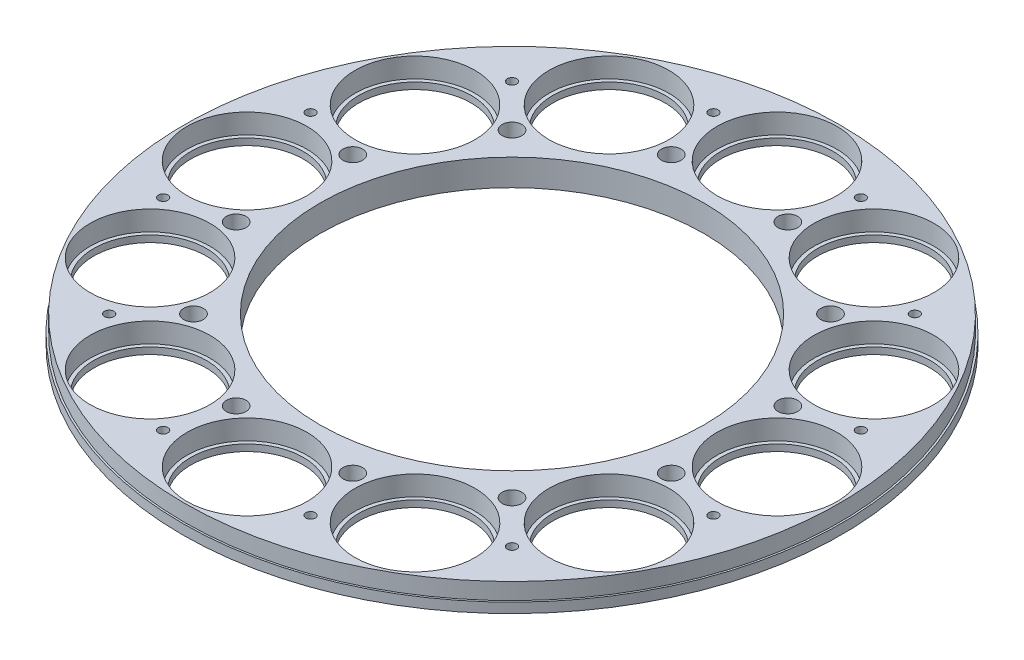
from build123d import *

# Parameters (mm, degrees)
SKETCH1_R                      = 157.95625
BOSS_EXTRUDE1_DEPTH            = 12.7
SKETCH2_R                      = 28.7655
CUT_EXTRUDE1_DEPTH             = 9.525
SKETCH3_R                      = 26.9875
CUT_EXTRUDE2_DEPTH             = 224.586849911
CIRPATTERN1_COUNT              = 12
SKETCH4_R                      = 92.075
CUT_EXTRUDE3_DEPTH             = 224.744595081
SKETCH5_W                      = 0.889
SKETCH5_H                      = 7.9375
CIRPATTERN2_COUNT              = 12
SKETCH12_R                     = 1.27
CUT_EXTRUDE5_DEPTH             = 224.744595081
CBORE_FOR_M4_SHCS2_D           = 4.5
CBORE_FOR_M4_SHCS2_DEPTH       = 12.7
CBORE_FOR_M4_SHCS2_CBORE_D     = 11.43
CBORE_FOR_M4_SHCS2_CBORE_DEPTH = 6
CUT_EXTRUDE6_START             = -6
CUT_EXTRUDE6_DEPTH             = 6
CIRPATTERN4_COUNT              = 12
CUT_EXTRUDE7_DEPTH             = 1.27


with BuildPart() as part:
    # Sketch1 → Boss-Extrude1 (new body)
    with BuildSketch(Plane(origin=(0, 0, 0), x_dir=(1, 0, 0), z_dir=(0, 1, 0))):
        with Locations(Location((0, 0, 0), (0, 0, 270))):
            Circle(SKETCH1_R)
    extrude(amount=BOSS_EXTRUDE1_DEPTH)

    # Sketch2 → Cut-Extrude1 (cut)
    with BuildSketch(Plane(origin=(0, 12.7, 0), x_dir=(1, 0, 0), z_dir=(0, 1, 0))):
        with Locations(Location((0, 127, 0), (0, 0, 270))):
            Circle(SKETCH2_R)
    cut_extrude1 = extrude(amount=-CUT_EXTRUDE1_DEPTH, mode=Mode.SUBTRACT)

    # Sketch3 → Cut-Extrude2 (cut, through all)
    with BuildSketch(Plane(origin=(0, 3.175, 0), x_dir=(1, 0, 0), z_dir=(0, 1, 0))):
        with Locations(Location((0, 127, 0), (0, 0, 270))):
            Circle(SKETCH3_R)
    cut_extrude2 = extrude(amount=-CUT_EXTRUDE2_DEPTH, mode=Mode.SUBTRACT)

    # CirPattern1: Cut-Extrude1, Cut-Extrude2 ×12 about axis
    cirpattern1_axis = Axis((0, 0, 0), (0, 1, 0))
    add([cut_extrude1.rotate(cirpattern1_axis, i * 360 / CIRPATTERN1_COUNT) for i in range(1, CIRPATTERN1_COUNT)], mode=Mode.SUBTRACT)
    add([cut_extrude2.rotate(cirpattern1_axis, i * 360 / CIRPATTERN1_COUNT) for i in range(1, CIRPATTERN1_COUNT)], mode=Mode.SUBTRACT)

    # Sketch4 → Cut-Extrude3 (cut, through all)
    with BuildSketch(Plane(origin=(0, 12.7, 0), x_dir=(1, 0, 0), z_dir=(0, 1, 0))):
        with Locations(Location((0, 0, 0), (0, 0, 270))):
            Circle(SKETCH4_R)
    extrude(amount=-CUT_EXTRUDE3_DEPTH, mode=Mode.SUBTRACT)

    # Sketch5 → Cut-Revolve1 (revolve, cut)
    with BuildSketch(Plane.XY, mode=Mode.PRIVATE) as cut_revolve1_sk:
        with Locations((157.51175, 8.73125)):
            Rectangle(SKETCH5_W, SKETCH5_H)
    revolve(cut_revolve1_sk.sketch.rotate(Axis((0, 50, 0), (0, -1, 0)), 90), axis=Axis((0, 50, 0), (0, -1, 0)), mode=Mode.SUBTRACT)

    # Sketch9 → CSK for M4 Flat Head Machine Screw1 (revolve, cut)
    with BuildSketch(Plane(origin=(27.939515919, 12.7, -104.271692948), x_dir=(0, 0, 1), z_dir=(1, 0, 0))):
        Polygon((0, 0), (0, 12.7), (2.25, 12.7), (2.25, 10.4500094), (4.7, 8.0000094), (4.7, 0), align=None)
    csk_for_m4_flat_head_machine_screw1 = revolve(axis=Axis((27.939515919, 19.05, -104.271692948), (0, -1, 0)), mode=Mode.SUBTRACT)

    # CirPattern2: CSK for M4 Flat Head Machine Screw1 ×12 about axis
    cirpattern2_axis = Axis((0, 0, 0), (0, 1, 0))
    for i in range(1, CIRPATTERN2_COUNT):
        add(csk_for_m4_flat_head_machine_screw1.rotate(cirpattern2_axis, i * 360 / CIRPATTERN2_COUNT), mode=Mode.SUBTRACT)

    # Sketch12 → Cut-Extrude5 (cut, through all)
    with BuildSketch(Plane(origin=(0, 0, 0), x_dir=(1, 0, 0), z_dir=(0, 1, 0))):
        with Locations(Location((35.335270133, 131.873023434, 0), (0, 0, 270))):
            Circle(SKETCH12_R)
    cut_extrude5 = extrude(amount=CUT_EXTRUDE5_DEPTH, mode=Mode.SUBTRACT)

    # CBORE for M4 SHCS2
    with Locations(Plane(origin=(0, 0, 0), x_dir=(-1, 0, 0), z_dir=(0, -1, 0))):
        with Locations((-35.335270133, 131.873023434)):
            cbore_for_m4_shcs2 = CounterBoreHole(CBORE_FOR_M4_SHCS2_D / 2, CBORE_FOR_M4_SHCS2_CBORE_D / 2, CBORE_FOR_M4_SHCS2_CBORE_DEPTH, depth=CBORE_FOR_M4_SHCS2_DEPTH)

    # Sketch17 → Cut-Extrude6 (cut)
    with BuildSketch(Plane.XZ.offset(CUT_EXTRUDE6_START)):
        with BuildLine():
            Line((33.161937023, -132.455366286), (29.874935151, -120.188108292))
            ThreePointArc((29.874935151, -120.188108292), (31.465925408, -117.432432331), (34.221601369, -119.023422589))
            Line((34.221601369, -119.023422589), (37.508603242, -131.290680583))
            ThreePointArc((37.508603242, -131.290680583), (35.917612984, -134.046356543), (33.161937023, -132.455366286))
        make_face()
    cut_extrude6 = extrude(amount=CUT_EXTRUDE6_DEPTH, mode=Mode.SUBTRACT)

    # CirPattern4: Cut-Extrude5, CBORE for M4 SHCS2, Cut-Extrude6 ×12 about axis
    cirpattern4_axis = Axis((0, 0, 0), (0, 1, 0))
    add([cut_extrude5.rotate(cirpattern4_axis, i * 360 / CIRPATTERN4_COUNT) for i in range(1, CIRPATTERN4_COUNT)], mode=Mode.SUBTRACT)
    add([cbore_for_m4_shcs2.rotate(cirpattern4_axis, i * 360 / CIRPATTERN4_COUNT) for i in range(1, CIRPATTERN4_COUNT)], mode=Mode.SUBTRACT)
    add([cut_extrude6.rotate(cirpattern4_axis, i * 360 / CIRPATTERN4_COUNT) for i in range(1, CIRPATTERN4_COUNT)], mode=Mode.SUBTRACT)

    # Sketch18 → Cut-Extrude7 (cut)
    # profile 1 of 15: a face of its own
    with BuildSketch(Plane.XZ):
        Polygon((-145.522341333, -32.08280496), (-147.287926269, -32.417350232), (-148.45947074, -26.218722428), (-147.287926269, -25.996116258), (-146.32499558, -31.086801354), (-145.049144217, -30.846386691), align=None)
    # profile 2 of 15: a face of its own
    with BuildSketch(Plane.XZ):
        with BuildLine():
            Line((-111.4209288, -99.098916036), (-110.520327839, -98.343327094))
            add(Edge.make_bspline(
                [(-110.520327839, -98.343327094), (-110.470740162, -98.410328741), (-110.373838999, -98.541259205), (-110.252591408, -98.747636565), (-110.149053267, -98.95241026), (-110.069738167, -99.159129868), (-110.013791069, -99.366868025), (-109.977079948, -99.574567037), (-109.964681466, -99.783622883), (-109.973786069, -99.991545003), (-110.002623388, -100.196205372), (-110.052577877, -100.394895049), (-110.12297787, -100.586098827), (-110.212347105, -100.770503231), (-110.322457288, -100.946974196), (-110.453691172, -101.114912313), (-110.602236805, -101.277986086), (-110.714781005, -101.376491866), (-110.772190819, -101.426740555)],
                knots=[0, 0, 0, 0, 1.154744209, 2.256529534, 3.313242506, 4.332799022, 5.319499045, 6.291612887, 7.251495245, 8.216331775, 9.172264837, 10.111720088, 11.050789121, 11.991897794, 12.947650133, 13.928168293, 14.943139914, 16, 16, 16, 16], degree=3))
            add(Edge.make_bspline(
                [(-110.772190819, -101.426740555), (-110.845473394, -101.484628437), (-110.988458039, -101.597575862), (-111.221663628, -101.731668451), (-111.46055209, -101.83377964), (-111.70633825, -101.90016235), (-111.955021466, -101.932724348), (-112.205513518, -101.928254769), (-112.45587317, -101.889898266), (-112.701935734, -101.816840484), (-112.93676861, -101.717226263), (-113.149697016, -101.589329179), (-113.34378118, -101.444500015), (-113.450304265, -101.326424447), (-113.503250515, -101.267736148)],
                knots=[0, 0, 0, 0, 1.102726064, 2.151574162, 3.169101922, 4.166152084, 5.151568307, 6.12408846, 7.117958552, 8.136276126, 9.151158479, 10.124259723, 11.067681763, 12, 12, 12, 12], degree=3))
            add(Edge.make_bspline(
                [(-113.503250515, -101.267736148), (-113.533107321, -101.230869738), (-113.593547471, -101.156239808), (-113.67435109, -101.03423535), (-113.751064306, -100.904668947), (-113.820700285, -100.765914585), (-113.883970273, -100.619094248), (-113.943310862, -100.464567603), (-113.994719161, -100.300828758), (-114.041012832, -100.127360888), (-114.081395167, -99.941684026), (-114.110205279, -99.740490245), (-114.135911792, -99.523474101), (-114.147743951, -99.289837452), (-114.156488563, -99.040049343), (-114.154134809, -98.774051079), (-114.145559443, -98.491563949), (-114.13384611, -98.297933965), (-114.127819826, -98.198315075)],
                knots=[0, 0, 0, 0, 0.709226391, 1.43571115, 2.186242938, 2.960568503, 3.755882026, 4.576878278, 5.435356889, 6.321480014, 7.26188766, 8.27545705, 9.360351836, 10.529408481, 11.773070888, 13.098615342, 14.507293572, 16, 16, 16, 16], degree=3))
            Line((-114.127819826, -98.198315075), (-114.064218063, -97.167966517))
            Line((-114.064218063, -97.167966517), (-115.792913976, -98.618086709))
            Line((-115.792913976, -98.618086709), (-116.510341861, -97.763279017))
            Line((-116.510341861, -97.763279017), (-113.148352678, -94.943176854))
            Line((-113.148352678, -94.943176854), (-112.776918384, -95.385845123))
            Line((-112.776918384, -95.385845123), (-112.994436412, -98.17541844))
            add(Edge.make_bspline(
                [(-112.994436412, -98.17541844), (-113.000791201, -98.256801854), (-113.013029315, -98.413530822), (-113.024005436, -98.640900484), (-113.031151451, -98.851664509), (-113.030918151, -99.046799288), (-113.026160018, -99.225398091), (-113.016442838, -99.387978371), (-113.000589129, -99.534177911), (-112.970247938, -99.703306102), (-112.922881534, -99.892498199), (-112.84729198, -100.095330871), (-112.760576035, -100.274843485), (-112.684006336, -100.375806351), (-112.647170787, -100.424376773)],
                knots=[0, 0, 0, 0, 1.261671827, 2.42973983, 3.518165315, 4.520897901, 5.445356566, 6.279339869, 7.037828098, 7.716645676, 8.934243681, 10.045727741, 11.059854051, 12, 12, 12, 12], degree=3))
            add(Edge.make_bspline(
                [(-112.647170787, -100.424376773), (-112.607232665, -100.467733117), (-112.529729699, -100.551869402), (-112.388493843, -100.645926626), (-112.235906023, -100.710567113), (-112.071754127, -100.738774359), (-111.904150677, -100.735852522), (-111.739589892, -100.695998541), (-111.579975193, -100.623846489), (-111.486157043, -100.551149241), (-111.437465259, -100.513419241)],
                knots=[0, 0, 0, 0, 1.037778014, 2.013887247, 2.970618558, 3.944427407, 4.933093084, 5.910235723, 6.915408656, 8, 8, 8, 8], degree=3))
            add(Edge.make_bspline(
                [(-111.437465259, -100.513419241), (-111.413717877, -100.492239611), (-111.367096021, -100.450658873), (-111.305695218, -100.381837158), (-111.254336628, -100.308027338), (-111.210546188, -100.230353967), (-111.176690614, -100.147729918), (-111.150606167, -100.061327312), (-111.134323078, -99.970429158), (-111.124048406, -99.843118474), (-111.136476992, -99.678702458), (-111.190099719, -99.48084783), (-111.286527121, -99.284588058), (-111.374880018, -99.162531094), (-111.4209288, -99.098916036)],
                knots=[0, 0, 0, 0, 0.725732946, 1.424789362, 2.098546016, 2.774245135, 3.455257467, 4.131787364, 4.830173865, 5.558160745, 7.042345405, 8.565596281, 10.210017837, 12, 12, 12, 12], degree=3))
        make_face()
    # profile 3 of 15: a face of its own
    with BuildSketch(Plane.XZ):
        with BuildLine():
            Line((-46.573525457, -141.800478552), (-46.180466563, -140.720520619))
            add(Edge.make_bspline(
                [(-46.180466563, -140.720520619), (-46.130005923, -140.747779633), (-46.030995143, -140.801265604), (-45.892095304, -140.892612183), (-45.763247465, -140.988396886), (-45.64706625, -141.092221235), (-45.541658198, -141.201810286), (-45.449482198, -141.31919422), (-45.366186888, -141.441701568), (-45.321392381, -141.529026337), (-45.29894613, -141.572784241)],
                knots=[0, 0, 0, 0, 1.102522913, 2.163303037, 3.194038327, 4.187487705, 5.156472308, 6.114171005, 7.055022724, 8, 8, 8, 8], degree=3))
            add(Edge.make_bspline(
                [(-45.29894613, -141.572784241), (-45.271428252, -141.634200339), (-45.216805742, -141.756110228), (-45.157233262, -141.945848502), (-45.118763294, -142.138202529), (-45.100871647, -142.332638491), (-45.103563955, -142.529166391), (-45.126767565, -142.728226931), (-45.171357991, -142.929233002), (-45.215494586, -143.061416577), (-45.237888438, -143.128483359)],
                knots=[0, 0, 0, 0, 1.007880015, 2.000624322, 2.972613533, 3.94252362, 4.921136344, 5.912639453, 6.940923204, 8, 8, 8, 8], degree=3))
            add(Edge.make_bspline(
                [(-45.237888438, -143.128483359), (-45.260506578, -143.187489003), (-45.304996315, -143.303552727), (-45.390036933, -143.466575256), (-45.485450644, -143.617488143), (-45.592709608, -143.756006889), (-45.712826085, -143.881019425), (-45.844912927, -143.993289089), (-45.987262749, -144.094596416), (-46.141101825, -144.179850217), (-46.299478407, -144.252249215), (-46.460119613, -144.307247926), (-46.620832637, -144.344681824), (-46.781079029, -144.364803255), (-46.941512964, -144.369733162), (-47.101292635, -144.353138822), (-47.261342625, -144.322056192), (-47.365458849, -144.288005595), (-47.418156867, -144.27077102)],
                knots=[0, 0, 0, 0, 1.107179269, 2.177814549, 3.217254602, 4.23441653, 5.243942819, 6.251084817, 7.270011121, 8.301873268, 9.329979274, 10.319740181, 11.27370252, 12.2179401, 13.147488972, 14.081042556, 15.02872723, 16, 16, 16, 16], degree=3))
            add(Edge.make_bspline(
                [(-47.418156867, -144.27077102), (-47.481379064, -144.244598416), (-47.606320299, -144.192875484), (-47.777387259, -144.083863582), (-47.929808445, -143.951414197), (-48.064352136, -143.797276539), (-48.175308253, -143.620220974), (-48.261931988, -143.423499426), (-48.325132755, -143.208330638), (-48.346139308, -143.05720555), (-48.356918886, -142.979655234)],
                knots=[0, 0, 0, 0, 0.972126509, 1.921139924, 2.870632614, 3.837145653, 4.821327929, 5.831425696, 6.887189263, 8, 8, 8, 8], degree=3))
            add(Edge.make_bspline(
                [(-48.356918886, -142.979655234), (-48.386957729, -143.018213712), (-48.4463272, -143.094421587), (-48.542588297, -143.200201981), (-48.645427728, -143.294080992), (-48.750369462, -143.380481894), (-48.862347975, -143.454049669), (-48.97799152, -143.51955635), (-49.09907534, -143.573941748), (-49.223527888, -143.618865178), (-49.351418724, -143.651618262), (-49.480632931, -143.674761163), (-49.610903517, -143.686363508), (-49.741931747, -143.685863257), (-49.874278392, -143.676030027), (-50.007869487, -143.654220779), (-50.142142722, -143.620919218), (-50.230391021, -143.591274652), (-50.275148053, -143.57623977)],
                knots=[0, 0, 0, 0, 1.083412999, 2.141282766, 3.165671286, 4.168351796, 5.151229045, 6.131811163, 7.112032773, 8.090224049, 9.061480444, 10.035099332, 10.997628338, 11.956432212, 12.936924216, 13.936780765, 14.953593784, 16, 16, 16, 16], degree=3))
            add(Edge.make_bspline(
                [(-50.275148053, -143.57623977), (-50.339765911, -143.550849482), (-50.466761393, -143.500949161), (-50.644928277, -143.40421757), (-50.80852508, -143.291917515), (-50.957729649, -143.163985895), (-51.094095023, -143.021909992), (-51.215323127, -142.863005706), (-51.321908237, -142.688496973), (-51.413217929, -142.500713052), (-51.486629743, -142.303496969), (-51.540316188, -142.099879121), (-51.57431858, -141.89242141), (-51.583022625, -141.68092517), (-51.575079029, -141.466206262), (-51.543146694, -141.248008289), (-51.493137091, -141.025417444), (-51.443009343, -140.879114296), (-51.417435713, -140.804474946)],
                knots=[0, 0, 0, 0, 0.994534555, 1.954589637, 2.898773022, 3.834327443, 4.767271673, 5.716781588, 6.693604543, 7.694028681, 8.705691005, 9.705320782, 10.708639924, 11.712768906, 12.734841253, 13.784450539, 14.869695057, 16, 16, 16, 16], degree=3))
            add(Edge.make_bspline(
                [(-51.417435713, -140.804474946), (-51.390784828, -140.73477785), (-51.338581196, -140.598255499), (-51.239299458, -140.407488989), (-51.129554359, -140.231153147), (-51.006737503, -140.071037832), (-50.870107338, -139.927281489), (-50.722631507, -139.798058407), (-50.561372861, -139.685457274), (-50.388124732, -139.590893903), (-50.206543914, -139.510883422), (-50.016318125, -139.453164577), (-49.820498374, -139.412806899), (-49.618352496, -139.394402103), (-49.410581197, -139.394531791), (-49.196476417, -139.414037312), (-48.976438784, -139.453329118), (-48.829827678, -139.493928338), (-48.755065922, -139.514631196)],
                knots=[0, 0, 0, 0, 1.082945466, 2.121268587, 3.117389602, 4.096616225, 5.046253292, 5.993431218, 6.939868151, 7.896289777, 8.856115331, 9.816414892, 10.777760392, 11.755126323, 12.758908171, 13.791462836, 14.873795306, 16, 16, 16, 16], degree=3))
            Line((-48.755065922, -139.514631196), (-49.159573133, -140.62639001))
            add(Edge.make_bspline(
                [(-49.159573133, -140.62639001), (-49.1989343, -140.619529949), (-49.275672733, -140.606155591), (-49.389149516, -140.594927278), (-49.497090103, -140.590494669), (-49.600174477, -140.595342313), (-49.697389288, -140.609908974), (-49.789811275, -140.629259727), (-49.876297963, -140.659233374), (-49.983024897, -140.709539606), (-50.106460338, -140.790005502), (-50.232033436, -140.915402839), (-50.336443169, -141.067233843), (-50.384082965, -141.182476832), (-50.408711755, -141.242055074)],
                knots=[0, 0, 0, 0, 0.934504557, 1.821907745, 2.665652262, 3.46026201, 4.231874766, 4.963554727, 5.666282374, 6.367467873, 7.721170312, 9.089047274, 10.495097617, 12, 12, 12, 12], degree=3))
            add(Edge.make_bspline(
                [(-50.408711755, -141.242055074), (-50.428597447, -141.305950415), (-50.467364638, -141.430514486), (-50.482460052, -141.623287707), (-50.45944985, -141.810812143), (-50.397641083, -141.988002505), (-50.305654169, -142.149384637), (-50.185452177, -142.287050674), (-50.038460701, -142.397338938), (-49.925715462, -142.445140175), (-49.868096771, -142.469569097)],
                knots=[0, 0, 0, 0, 1.071422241, 2.088739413, 3.076371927, 4.083600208, 5.080521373, 6.040207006, 6.998443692, 8, 8, 8, 8], degree=3))
            add(Edge.make_bspline(
                [(-49.868096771, -142.469569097), (-49.834830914, -142.480647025), (-49.769239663, -142.502489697), (-49.667749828, -142.519323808), (-49.566569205, -142.527110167), (-49.465543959, -142.517759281), (-49.363565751, -142.501031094), (-49.262407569, -142.468213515), (-49.160813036, -142.424772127), (-49.06040643, -142.368263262), (-48.961328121, -142.300603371), (-48.868105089, -142.217560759), (-48.778828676, -142.123356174), (-48.694716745, -142.015903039), (-48.616565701, -141.895594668), (-48.540363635, -141.764434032), (-48.472476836, -141.618605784), (-48.43147201, -141.516169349), (-48.410344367, -141.463389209)],
                knots=[0, 0, 0, 0, 0.850185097, 1.676334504, 2.49143665, 3.30725394, 4.133403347, 4.996461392, 5.882075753, 6.813213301, 7.790086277, 8.78975826, 9.838652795, 10.938665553, 12.098180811, 13.320465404, 14.6193759, 16, 16, 16, 16], degree=3))
            Line((-48.410344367, -141.463389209), (-47.447413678, -141.813198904))
            add(Edge.make_bspline(
                [(-47.447413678, -141.813198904), (-47.464362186, -141.878729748), (-47.49610039, -142.001444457), (-47.528224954, -142.176083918), (-47.545370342, -142.327935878), (-47.543696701, -142.459715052), (-47.524891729, -142.575807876), (-47.494507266, -142.681281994), (-47.452566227, -142.779961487), (-47.396209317, -142.868433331), (-47.330475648, -142.947327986), (-47.256511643, -143.013932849), (-47.174605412, -143.067911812), (-47.115026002, -143.092929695), (-47.08488363, -143.105586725)],
                knots=[0, 0, 0, 0, 1.634768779, 3.061309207, 4.286473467, 5.321274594, 6.234043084, 7.119087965, 7.967820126, 8.814757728, 9.64366266, 10.441608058, 11.211579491, 12, 12, 12, 12], degree=3))
            add(Edge.make_bspline(
                [(-47.08488363, -143.105586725), (-47.045391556, -143.117991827), (-46.968896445, -143.142020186), (-46.84932565, -143.147529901), (-46.732947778, -143.130087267), (-46.621553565, -143.085504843), (-46.518847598, -143.019814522), (-46.428812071, -142.932405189), (-46.355612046, -142.823767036), (-46.321497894, -142.741225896), (-46.303853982, -142.698535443)],
                knots=[0, 0, 0, 0, 1.003292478, 1.943351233, 2.882843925, 3.846321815, 4.839167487, 5.831209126, 6.878296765, 8, 8, 8, 8], degree=3))
            add(Edge.make_bspline(
                [(-46.303853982, -142.698535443), (-46.291566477, -142.658555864), (-46.267224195, -142.579353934), (-46.253086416, -142.455808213), (-46.261404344, -142.331167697), (-46.289656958, -142.207888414), (-46.334611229, -142.088718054), (-46.397577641, -141.979894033), (-46.476331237, -141.88152029), (-46.540703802, -141.827845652), (-46.573525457, -141.800478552)],
                knots=[0, 0, 0, 0, 1.000238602, 1.981532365, 2.958349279, 3.978343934, 5.000560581, 5.996925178, 6.978691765, 8, 8, 8, 8], degree=3))
        make_face()
    # profile 4 of 15: a face of its own
    with BuildSketch(Plane.XZ):
        Polygon((32.473319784, -147.010622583), (32.681933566, -148.189799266), (28.691558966, -148.893234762), (28.788233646, -149.445298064), (27.696827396, -149.638647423), (27.600152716, -149.086584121), (26.32811746, -149.310462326), (26.124591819, -148.156726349), (27.396627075, -147.932848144), (26.919613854, -145.227229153), (28.011020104, -145.033879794), align=None)
        Polygon((28.488033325, -147.739498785), (30.565266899, -147.373152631), (28.23744238, -146.323723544), align=None, mode=Mode.SUBTRACT)
    # profile 5 of 15: a face of its own
    with BuildSketch(Plane.XZ):
        with BuildLine():
            Line((100.620271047, -110.059852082), (102.528323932, -112.332979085))
            Line((102.528323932, -112.332979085), (101.677332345, -113.046590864))
            Line((101.677332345, -113.046590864), (100.348055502, -111.46290697))
            Line((100.348055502, -111.46290697), (99.298626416, -112.00733806))
            add(Edge.make_bspline(
                [(99.298626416, -112.00733806), (99.328264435, -112.028047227), (99.387027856, -112.069107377), (99.466970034, -112.138130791), (99.541947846, -112.207218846), (99.585273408, -112.257507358), (99.606458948, -112.282097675)],
                knots=[0, 0, 0, 0, 1.047578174, 2.077037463, 3.059700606, 4, 4, 4, 4], degree=3))
            add(Edge.make_bspline(
                [(99.606458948, -112.282097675), (99.650240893, -112.337352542), (99.736186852, -112.445820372), (99.846689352, -112.618070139), (99.934148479, -112.796705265), (100.005827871, -112.978606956), (100.053444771, -113.167232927), (100.083340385, -113.360159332), (100.091954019, -113.558034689), (100.080167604, -113.75823006), (100.049915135, -113.957188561), (100.000845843, -114.15155701), (99.92940901, -114.33791839), (99.842122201, -114.518615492), (99.732847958, -114.69068279), (99.604599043, -114.855837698), (99.456738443, -115.013718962), (99.346923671, -115.111110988), (99.290994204, -115.16071346)],
                knots=[0, 0, 0, 0, 1.042793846, 2.047051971, 3.020681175, 3.981941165, 4.934542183, 5.892849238, 6.866316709, 7.859222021, 8.855688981, 9.840233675, 10.819084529, 11.803969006, 12.804870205, 13.828923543, 14.894254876, 16, 16, 16, 16], degree=3))
            add(Edge.make_bspline(
                [(99.290994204, -115.16071346), (99.231661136, -115.20813371), (99.11513031, -115.301267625), (98.927547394, -115.418568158), (98.735079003, -115.515688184), (98.537188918, -115.592747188), (98.333392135, -115.647981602), (98.123522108, -115.680720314), (97.907983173, -115.693304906), (97.689540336, -115.685563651), (97.473019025, -115.658252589), (97.263548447, -115.609426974), (97.063372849, -115.542503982), (96.873511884, -115.454926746), (96.693239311, -115.34881301), (96.522462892, -115.223519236), (96.360374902, -115.079518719), (96.264120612, -114.969725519), (96.215212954, -114.91393862)],
                knots=[0, 0, 0, 0, 1.05961704, 2.081100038, 3.081738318, 4.06556804, 5.040543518, 6.023429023, 7.025536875, 8.050187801, 9.070727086, 10.067207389, 11.048058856, 12.012156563, 12.980641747, 13.963313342, 14.965141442, 16, 16, 16, 16], degree=3))
            add(Edge.make_bspline(
                [(96.215212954, -114.91393862), (96.173629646, -114.862440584), (96.091465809, -114.760686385), (95.985256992, -114.59898948), (95.894105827, -114.434019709), (95.818752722, -114.265527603), (95.758378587, -114.092836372), (95.714256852, -113.916089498), (95.684188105, -113.735750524), (95.672411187, -113.552655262), (95.673654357, -113.368661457), (95.695548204, -113.18678501), (95.728583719, -113.007037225), (95.78227307, -112.831396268), (95.848968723, -112.657001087), (95.935955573, -112.487388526), (96.033844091, -112.317590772), (96.112771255, -112.211403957), (96.152883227, -112.15743822)],
                knots=[0, 0, 0, 0, 1.059339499, 2.09313307, 3.092856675, 4.074503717, 5.045029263, 6.018210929, 6.988166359, 7.968192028, 8.952746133, 9.929686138, 10.897714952, 11.875126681, 12.866120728, 13.883282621, 14.924252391, 16, 16, 16, 16], degree=3))
            Line((96.152883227, -112.15743822), (96.965713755, -113.126729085))
            add(Edge.make_bspline(
                [(96.965713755, -113.126729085), (96.945800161, -113.176333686), (96.907017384, -113.272941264), (96.871108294, -113.421817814), (96.856453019, -113.568293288), (96.864205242, -113.711500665), (96.892281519, -113.848916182), (96.938833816, -113.979524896), (97.003564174, -114.103241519), (97.061184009, -114.17696978), (97.090373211, -114.214319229)],
                knots=[0, 0, 0, 0, 1.107483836, 2.156883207, 3.164053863, 4.150392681, 5.119648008, 6.062575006, 7.01853435, 8, 8, 8, 8], degree=3))
            add(Edge.make_bspline(
                [(97.090373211, -114.214319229), (97.111899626, -114.238997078), (97.154371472, -114.287686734), (97.226235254, -114.350929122), (97.301609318, -114.406606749), (97.382642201, -114.452326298), (97.467660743, -114.490689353), (97.557226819, -114.519968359), (97.65097258, -114.540562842), (97.748117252, -114.551381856), (97.847013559, -114.554958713), (97.945330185, -114.544945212), (98.042305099, -114.527970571), (98.136889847, -114.498868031), (98.230593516, -114.46285562), (98.320664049, -114.413036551), (98.41067514, -114.356208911), (98.467120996, -114.311135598), (98.495972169, -114.288097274)],
                knots=[0, 0, 0, 0, 0.998561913, 1.970173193, 2.915040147, 3.854128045, 4.804210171, 5.757811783, 6.725017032, 7.728348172, 8.738169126, 9.738825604, 10.738979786, 11.73812862, 12.754727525, 13.796953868, 14.873956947, 16, 16, 16, 16], degree=3))
            add(Edge.make_bspline(
                [(98.495972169, -114.288097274), (98.523158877, -114.264421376), (98.576156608, -114.218267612), (98.64646061, -114.14179309), (98.709228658, -114.063830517), (98.761111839, -113.981238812), (98.806896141, -113.897448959), (98.840688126, -113.809091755), (98.866637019, -113.718041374), (98.882740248, -113.624638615), (98.890447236, -113.53139201), (98.889302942, -113.440213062), (98.879288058, -113.352357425), (98.860003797, -113.267496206), (98.831776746, -113.185656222), (98.794771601, -113.106058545), (98.747684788, -113.030032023), (98.710551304, -112.982658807), (98.691865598, -112.958820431)],
                knots=[0, 0, 0, 0, 1.153198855, 2.248044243, 3.320703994, 4.352388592, 5.36642086, 6.37215209, 7.373385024, 8.393214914, 9.400959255, 10.36478203, 11.307635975, 12.226340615, 13.144944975, 14.07401952, 15.030839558, 16, 16, 16, 16], degree=3))
            add(Edge.make_bspline(
                [(98.691865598, -112.958820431), (98.669454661, -112.934597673), (98.624544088, -112.886056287), (98.547757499, -112.821341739), (98.459856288, -112.768536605), (98.364303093, -112.722137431), (98.259032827, -112.685926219), (98.146113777, -112.656164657), (98.023697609, -112.637574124), (97.9392974, -112.631327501), (97.895571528, -112.628091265)],
                knots=[0, 0, 0, 0, 0.892287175, 1.788105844, 2.704827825, 3.659028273, 4.656635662, 5.710982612, 6.814110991, 8, 8, 8, 8], degree=3))
            Line((97.895571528, -112.628091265), (97.432550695, -111.733850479))
            Line((97.432550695, -111.733850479), (100.620271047, -110.059852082))
        make_face()
    # profile 6 of 15: a face of its own
    with BuildSketch(Plane.XZ):
        with BuildLine():
            Line((143.208621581, -45.267145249), (143.989651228, -46.09269613))
            Line((143.989651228, -46.09269613), (142.226610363, -47.724717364))
            add(Edge.make_bspline(
                [(142.226610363, -47.724717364), (142.287335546, -47.748571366), (142.407065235, -47.795603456), (142.575918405, -47.885573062), (142.731590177, -47.989886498), (142.873749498, -48.109155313), (143.002741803, -48.242231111), (143.119577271, -48.389103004), (143.220914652, -48.551899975), (143.309498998, -48.725835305), (143.381140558, -48.908305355), (143.4374431, -49.093841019), (143.469490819, -49.283141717), (143.485926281, -49.473904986), (143.479519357, -49.666895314), (143.457400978, -49.862232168), (143.412175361, -50.05918124), (143.369112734, -50.188971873), (143.347273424, -50.254795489)],
                knots=[0, 0, 0, 0, 1.014640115, 2.000529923, 2.97048061, 3.926004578, 4.882598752, 5.850257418, 6.840663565, 7.861698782, 8.883607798, 9.887896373, 10.87292463, 11.865855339, 12.862571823, 13.87254532, 14.921056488, 16, 16, 16, 16], degree=3))
            add(Edge.make_bspline(
                [(143.347273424, -50.254795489), (143.322576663, -50.317221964), (143.273861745, -50.440359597), (143.181540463, -50.613693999), (143.075766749, -50.773688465), (142.955216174, -50.920052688), (142.82009668, -51.052182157), (142.671131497, -51.171726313), (142.507867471, -51.277320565), (142.332157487, -51.367998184), (142.149465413, -51.442357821), (141.963531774, -51.499363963), (141.776807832, -51.535893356), (141.588898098, -51.554756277), (141.400514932, -51.551098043), (141.210819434, -51.531260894), (141.020279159, -51.490362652), (140.89570912, -51.448743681), (140.832459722, -51.427611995)],
                knots=[0, 0, 0, 0, 1.043038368, 2.057416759, 3.046505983, 4.02049913, 4.999387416, 5.979451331, 6.985074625, 8.016971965, 9.04889036, 10.04775017, 11.035432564, 12.002261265, 12.977948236, 13.959230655, 14.963816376, 16, 16, 16, 16], degree=3))
            add(Edge.make_bspline(
                [(140.832459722, -51.427611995), (140.767896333, -51.402106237), (140.640845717, -51.351914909), (140.462389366, -51.25705763), (140.297952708, -51.148490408), (140.148756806, -51.024725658), (140.014289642, -50.886658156), (139.895516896, -50.733977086), (139.790550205, -50.567473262), (139.70138509, -50.38879397), (139.630079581, -50.203095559), (139.574086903, -50.016640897), (139.538733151, -49.830302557), (139.520691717, -49.645516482), (139.520229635, -49.461802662), (139.539831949, -49.279004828), (139.57737768, -49.096848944), (139.616885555, -48.978602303), (139.636746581, -48.91915847)],
                knots=[0, 0, 0, 0, 1.078845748, 2.122999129, 3.136149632, 4.138275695, 5.131489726, 6.12734863, 7.140820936, 8.187656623, 9.227261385, 10.230839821, 11.211077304, 12.171623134, 13.114535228, 14.062620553, 15.02605892, 16, 16, 16, 16], degree=3))
            add(Edge.make_bspline(
                [(139.636746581, -48.91915847), (139.654208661, -48.87387491), (139.689420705, -48.782561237), (139.75665267, -48.65116226), (139.83134775, -48.521601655), (139.904402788, -48.416695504), (139.972240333, -48.330527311), (140.033105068, -48.258201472), (140.104904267, -48.179362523), (140.186025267, -48.093400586), (140.276421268, -47.999740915), (140.378372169, -47.901540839), (140.489377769, -47.794990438), (140.567737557, -47.72287398), (140.608581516, -47.685284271)],
                knots=[0, 0, 0, 0, 1.099995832, 2.218126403, 3.342935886, 4.489969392, 5.113245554, 5.829831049, 6.63323116, 7.531202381, 8.510452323, 9.584889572, 10.741156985, 12, 12, 12, 12], degree=3))
            Line((140.608581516, -47.685284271), (143.208621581, -45.267145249))
        make_face()
        with BuildLine():
            add(Edge.make_bspline(
                [(141.775037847, -48.763970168), (141.72378447, -48.747935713), (141.623725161, -48.716632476), (141.466519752, -48.71200355), (141.312202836, -48.737318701), (141.164239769, -48.797173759), (141.026695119, -48.881962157), (140.910758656, -48.996045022), (140.813284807, -49.131790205), (140.770576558, -49.236486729), (140.748505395, -49.290592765)],
                knots=[0, 0, 0, 0, 0.997783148, 1.947920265, 2.902525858, 3.897073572, 4.906703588, 5.896963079, 6.913173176, 8, 8, 8, 8], degree=3))
            add(Edge.make_bspline(
                [(140.748505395, -49.290592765), (140.730928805, -49.346492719), (140.69671986, -49.45528962), (140.684973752, -49.624676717), (140.703585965, -49.790319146), (140.756396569, -49.947843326), (140.833865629, -50.09108919), (140.934735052, -50.211547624), (141.055288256, -50.308512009), (141.148883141, -50.348856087), (141.196261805, -50.369278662)],
                knots=[0, 0, 0, 0, 1.082478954, 2.106805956, 3.119284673, 4.152789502, 5.165390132, 6.118975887, 7.047806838, 8, 8, 8, 8], degree=3))
            add(Edge.make_bspline(
                [(141.196261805, -50.369278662), (141.247953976, -50.385194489), (141.34932626, -50.416406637), (141.50887518, -50.422580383), (141.666824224, -50.398298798), (141.819911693, -50.340293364), (141.962471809, -50.25474473), (142.084898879, -50.140607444), (142.186314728, -50.001537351), (142.230494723, -49.894267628), (142.253323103, -49.83883996)],
                knots=[0, 0, 0, 0, 0.982277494, 1.926320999, 2.880591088, 3.878344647, 4.891013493, 5.891845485, 6.910689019, 8, 8, 8, 8], degree=3))
            add(Edge.make_bspline(
                [(142.253323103, -49.83883996), (142.270898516, -49.783366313), (142.3050944, -49.675433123), (142.316834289, -49.507736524), (142.298439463, -49.344489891), (142.244905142, -49.18956079), (142.166476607, -49.047017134), (142.05924331, -48.926251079), (141.928542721, -48.827688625), (141.827073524, -48.785569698), (141.775037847, -48.763970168)],
                knots=[0, 0, 0, 0, 1.060095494, 2.062591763, 3.045738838, 4.042951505, 5.038597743, 5.999261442, 6.973976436, 8, 8, 8, 8], degree=3))
        make_face(mode=Mode.SUBTRACT)
    # profile 7 of 15: a face of its own
    with BuildSketch(Plane.XZ):
        Polygon((144.699335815, 31.905992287), (148.76603253, 32.623420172), (148.874155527, 32.003939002), (147.089490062, 25.774782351), (146.003171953, 26.082614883), (147.490181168, 31.255982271), (144.89395721, 30.798049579), align=None)
    # profile 8 of 15: a face of its own
    with BuildSketch(Plane.XZ):
        with BuildLine():
            add(Edge.make_bspline(
                [(113.685151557, 99.873585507), (113.768604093, 99.881130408), (113.933324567, 99.896022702), (114.179814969, 99.882827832), (114.419570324, 99.837822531), (114.651103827, 99.762570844), (114.871373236, 99.659237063), (115.077617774, 99.530459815), (115.266821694, 99.374228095), (115.376313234, 99.252187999), (115.431655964, 99.190502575)],
                knots=[0, 0, 0, 0, 1.02652461, 2.026177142, 3.015362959, 4.010149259, 5.003371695, 5.991573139, 6.984836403, 8, 8, 8, 8], degree=3))
            add(Edge.make_bspline(
                [(115.431655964, 99.190502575), (115.486616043, 99.119772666), (115.595436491, 98.979728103), (115.723589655, 98.746761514), (115.816307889, 98.499209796), (115.877247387, 98.241898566), (115.904580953, 97.980996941), (115.894771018, 97.722543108), (115.846792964, 97.471232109), (115.778056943, 97.268372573), (115.703135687, 97.111244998), (115.63692513, 96.992361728), (115.559047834, 96.874581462), (115.471267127, 96.756847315), (115.370724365, 96.641439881), (115.262023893, 96.523982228), (115.140981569, 96.408491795), (115.054629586, 96.334393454), (115.010612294, 96.296622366)],
                knots=[0, 0, 0, 0, 1.303022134, 2.579971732, 3.854185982, 5.142314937, 6.420995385, 7.663189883, 8.89490284, 10.134946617, 10.770270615, 11.428239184, 12.11504613, 12.82519217, 13.565313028, 14.342993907, 15.155353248, 16, 16, 16, 16], degree=3))
            add(Edge.make_bspline(
                [(115.010612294, 96.296622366), (114.962537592, 96.257284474), (114.868518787, 96.180352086), (114.726584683, 96.073337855), (114.586859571, 95.979089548), (114.449706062, 95.897517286), (114.31676905, 95.825357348), (114.18545714, 95.767188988), (114.057767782, 95.719319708), (113.892427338, 95.672130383), (113.685090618, 95.637533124), (113.43389984, 95.635908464), (113.18156766, 95.668981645), (112.97385377, 95.727801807), (112.810543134, 95.791282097), (112.691101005, 95.849084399), (112.574834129, 95.913403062), (112.46416115, 95.988020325), (112.357048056, 96.069487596), (112.253640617, 96.15892161), (112.153948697, 96.256501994), (112.092887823, 96.327942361), (112.062034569, 96.364040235)],
                knots=[0, 0, 0, 0, 1.113818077, 2.178273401, 3.186270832, 4.134241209, 5.039028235, 5.89671419, 6.707414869, 7.482350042, 8.977312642, 10.460024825, 11.970854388, 13.525975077, 14.318064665, 15.110446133, 15.903593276, 16.698596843, 17.501523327, 18.315497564, 19.148843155, 20, 20, 20, 20], degree=3))
            add(Edge.make_bspline(
                [(112.062034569, 96.364040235), (112.011599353, 96.428170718), (111.912374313, 96.554339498), (111.7938239, 96.761941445), (111.701597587, 96.977365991), (111.636803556, 97.202025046), (111.603358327, 97.436053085), (111.595473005, 97.678408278), (111.617270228, 97.92990136), (111.653140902, 98.097287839), (111.671519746, 98.183050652)],
                knots=[0, 0, 0, 0, 1.010672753, 1.988373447, 2.954337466, 3.911386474, 4.87889503, 5.878495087, 6.91301718, 8, 8, 8, 8], degree=3))
            add(Edge.make_bspline(
                [(111.671519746, 98.183050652), (111.606028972, 98.190767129), (111.477055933, 98.205963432), (111.290357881, 98.248710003), (111.113310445, 98.304248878), (110.947764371, 98.375856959), (110.791892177, 98.461235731), (110.648501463, 98.563720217), (110.514274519, 98.679764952), (110.435449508, 98.768118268), (110.395668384, 98.812708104)],
                knots=[0, 0, 0, 0, 1.08288218, 2.132553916, 3.141719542, 4.127920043, 5.091565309, 6.056192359, 7.019006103, 8, 8, 8, 8], degree=3))
            add(Edge.make_bspline(
                [(110.395668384, 98.812708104), (110.345953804, 98.876343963), (110.247801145, 99.001981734), (110.133276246, 99.210137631), (110.04822179, 99.428757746), (109.993823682, 99.655935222), (109.969747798, 99.888021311), (109.982753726, 100.119965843), (110.023906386, 100.350320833), (110.102075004, 100.576145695), (110.209797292, 100.796328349), (110.350337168, 101.006050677), (110.520679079, 101.205680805), (110.654056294, 101.323983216), (110.722581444, 101.384763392)],
                knots=[0, 0, 0, 0, 0.999010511, 1.972369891, 2.930187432, 3.897091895, 4.857670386, 5.809507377, 6.765508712, 7.747122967, 8.759519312, 9.793791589, 10.866517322, 12, 12, 12, 12], degree=3))
            add(Edge.make_bspline(
                [(110.722581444, 101.384763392), (110.792939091, 101.440868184), (110.930232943, 101.550349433), (111.153563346, 101.68034405), (111.382039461, 101.778577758), (111.615210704, 101.843989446), (111.850627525, 101.875614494), (112.085392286, 101.876842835), (112.318086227, 101.84080896), (112.546041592, 101.775118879), (112.763648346, 101.67970783), (112.967390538, 101.559631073), (113.152048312, 101.411605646), (113.25795928, 101.294682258), (113.311173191, 101.235935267)],
                knots=[0, 0, 0, 0, 1.116099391, 2.177923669, 3.196857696, 4.196985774, 5.174565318, 6.137980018, 7.101409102, 8.087780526, 9.075626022, 10.043503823, 11.01697799, 12, 12, 12, 12], degree=3))
            add(Edge.make_bspline(
                [(113.311173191, 101.235935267), (113.346057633, 101.192106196), (113.414753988, 101.105795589), (113.499937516, 100.965969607), (113.569674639, 100.821301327), (113.622658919, 100.667594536), (113.66135787, 100.499724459), (113.684791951, 100.311438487), (113.692985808, 100.100023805), (113.687850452, 99.951593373), (113.685151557, 99.873585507)],
                knots=[0, 0, 0, 0, 0.925558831, 1.822661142, 2.700793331, 3.576683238, 4.505317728, 5.544597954, 6.709559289, 8, 8, 8, 8], degree=3))
        make_face()
        with BuildLine():
            add(Edge.make_bspline(
                [(111.440009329, 100.468898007), (111.405223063, 100.43661471), (111.337963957, 100.374195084), (111.25992919, 100.261824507), (111.212171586, 100.137348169), (111.1870096, 100.005768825), (111.191108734, 99.871303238), (111.222762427, 99.739611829), (111.280597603, 99.612508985), (111.337932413, 99.537184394), (111.367503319, 99.498335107)],
                knots=[0, 0, 0, 0, 1.043468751, 2.017542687, 2.981851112, 3.960080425, 4.950495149, 5.920081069, 6.927264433, 8, 8, 8, 8], degree=3))
            add(Edge.make_bspline(
                [(111.367503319, 99.498335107), (111.400969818, 99.462145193), (111.466214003, 99.391591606), (111.584271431, 99.31147885), (111.713469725, 99.258536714), (111.850283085, 99.230258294), (111.989628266, 99.230372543), (112.125142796, 99.257395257), (112.253570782, 99.312457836), (112.328090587, 99.369027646), (112.366050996, 99.397844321)],
                knots=[0, 0, 0, 0, 1.054763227, 2.056300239, 3.030919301, 4.033405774, 5.033909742, 5.998932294, 6.980655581, 8, 8, 8, 8], degree=3))
            add(Edge.make_bspline(
                [(112.366050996, 99.397844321), (112.402246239, 99.43129936), (112.472376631, 99.496120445), (112.551824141, 99.61311466), (112.602134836, 99.740990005), (112.626396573, 99.876297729), (112.623144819, 100.01516381), (112.588365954, 100.151637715), (112.526428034, 100.284072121), (112.466036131, 100.363081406), (112.4347409, 100.404024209)],
                knots=[0, 0, 0, 0, 1.043507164, 2.021855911, 2.97096601, 3.940000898, 4.921200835, 5.894571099, 6.908961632, 8, 8, 8, 8], degree=3))
            add(Edge.make_bspline(
                [(112.4347409, 100.404024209), (112.401653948, 100.439738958), (112.337401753, 100.509094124), (112.222358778, 100.588040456), (112.096540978, 100.639486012), (111.962907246, 100.661288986), (111.825914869, 100.658620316), (111.691084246, 100.623725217), (111.559362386, 100.561587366), (111.480913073, 100.500663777), (111.440009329, 100.468898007)],
                knots=[0, 0, 0, 0, 1.040787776, 2.021126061, 2.962589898, 3.930513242, 4.903073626, 5.877075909, 6.89310002, 8, 8, 8, 8], degree=3))
        make_face(mode=Mode.SUBTRACT)
        with BuildLine():
            add(Edge.make_bspline(
                [(113.110191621, 98.554484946), (113.083372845, 98.53128769), (113.030426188, 98.485490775), (112.961279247, 98.408284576), (112.898450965, 98.329814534), (112.844088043, 98.247581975), (112.79956459, 98.160892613), (112.764393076, 98.070255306), (112.735631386, 97.976909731), (112.717208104, 97.880937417), (112.706494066, 97.785183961), (112.706777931, 97.691398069), (112.715439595, 97.601036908), (112.73325203, 97.514002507), (112.760154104, 97.430835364), (112.795800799, 97.351126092), (112.842234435, 97.27555689), (112.879053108, 97.228676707), (112.897761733, 97.204855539)],
                knots=[0, 0, 0, 0, 1.119483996, 2.21012826, 3.269031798, 4.2947758, 5.319556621, 6.342232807, 7.363855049, 8.401866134, 9.425858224, 10.404025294, 11.360005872, 12.2902859, 13.205583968, 14.117147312, 15.043268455, 16, 16, 16, 16], degree=3))
            add(Edge.make_bspline(
                [(112.897761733, 97.204855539), (112.918575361, 97.181593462), (112.959612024, 97.135729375), (113.027202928, 97.073995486), (113.10036344, 97.022124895), (113.176891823, 96.976680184), (113.258634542, 96.941323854), (113.344311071, 96.914335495), (113.434385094, 96.896805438), (113.527550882, 96.886737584), (113.623094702, 96.884704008), (113.718107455, 96.895535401), (113.812073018, 96.915037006), (113.90555115, 96.942350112), (113.996888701, 96.982853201), (114.087822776, 97.031157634), (114.177306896, 97.089878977), (114.233782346, 97.135657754), (114.262655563, 97.15906227)],
                knots=[0, 0, 0, 0, 0.979480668, 1.931168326, 2.865669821, 3.790166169, 4.719916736, 5.654418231, 6.604522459, 7.595152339, 8.593441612, 9.597304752, 10.58918554, 11.603930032, 12.647249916, 13.719044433, 14.833855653, 16, 16, 16, 16], degree=3))
            add(Edge.make_bspline(
                [(114.262655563, 97.15906227), (114.291124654, 97.183572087), (114.346662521, 97.231386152), (114.419917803, 97.309904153), (114.486411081, 97.388479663), (114.539964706, 97.471464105), (114.587281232, 97.554983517), (114.623870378, 97.641174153), (114.651196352, 97.729783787), (114.66721423, 97.819968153), (114.674892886, 97.910233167), (114.674181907, 97.999419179), (114.662232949, 98.086352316), (114.642020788, 98.171412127), (114.611122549, 98.253979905), (114.571410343, 98.334442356), (114.522776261, 98.413156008), (114.483680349, 98.46201741), (114.463637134, 98.487067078)],
                knots=[0, 0, 0, 0, 1.19208942, 2.325543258, 3.406592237, 4.456065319, 5.456624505, 6.452096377, 7.423319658, 8.395289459, 9.354772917, 10.297478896, 11.221142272, 12.135631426, 13.068670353, 14.014161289, 14.981924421, 16, 16, 16, 16], degree=3))
            add(Edge.make_bspline(
                [(114.463637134, 98.487067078), (114.442610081, 98.511404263), (114.401317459, 98.559197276), (114.329903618, 98.619844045), (114.256443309, 98.673938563), (114.178302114, 98.71858321), (114.096135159, 98.754886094), (114.009232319, 98.7808437), (113.918359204, 98.801009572), (113.792667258, 98.811335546), (113.633916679, 98.80734642), (113.448739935, 98.758602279), (113.269629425, 98.677449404), (113.164295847, 98.596212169), (113.110191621, 98.554484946)],
                knots=[0, 0, 0, 0, 0.764465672, 1.501246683, 2.223999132, 2.933809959, 3.638868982, 4.357168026, 5.089580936, 5.84983759, 7.354897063, 8.843213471, 10.37852758, 12, 12, 12, 12], degree=3))
        make_face(mode=Mode.SUBTRACT)
    # profile 9 of 15: a face of its own
    with BuildSketch(Plane.XZ):
        with BuildLine():
            Line((51.409803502, 140.784122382), (50.588068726, 140.001820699))
            Line((50.588068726, 140.001820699), (48.956047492, 141.764861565))
            add(Edge.make_bspline(
                [(48.956047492, 141.764861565), (48.932310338, 141.7040727), (48.88543591, 141.584031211), (48.793654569, 141.41593423), (48.689783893, 141.259738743), (48.56980793, 141.117853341), (48.438201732, 140.98720881), (48.289485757, 140.872306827), (48.128102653, 140.768907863), (47.953535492, 140.680985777), (47.771472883, 140.60845632), (47.585244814, 140.555039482), (47.396602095, 140.519542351), (47.205523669, 140.506744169), (47.012489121, 140.509595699), (46.817366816, 140.534715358), (46.620296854, 140.579124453), (46.490515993, 140.622301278), (46.424697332, 140.644198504)],
                knots=[0, 0, 0, 0, 1.014219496, 2.002807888, 2.972356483, 3.927484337, 4.888288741, 5.85146732, 6.844994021, 7.865605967, 8.887091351, 9.889120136, 10.874910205, 11.866925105, 12.863075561, 13.873427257, 14.921503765, 16, 16, 16, 16], degree=3))
            add(Edge.make_bspline(
                [(46.424697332, 140.644198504), (46.36182931, 140.668851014), (46.23817536, 140.717339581), (46.063972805, 140.810159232), (45.903726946, 140.916651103), (45.756885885, 141.037924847), (45.62345765, 141.172196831), (45.504012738, 141.321672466), (45.398335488, 141.484859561), (45.307696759, 141.660591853), (45.233267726, 141.843274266), (45.176492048, 142.02922364), (45.139053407, 142.216271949), (45.123309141, 142.404335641), (45.123556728, 142.592745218), (45.146318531, 142.781828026), (45.186418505, 142.972478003), (45.228148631, 143.097039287), (45.249336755, 143.160284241)],
                knots=[0, 0, 0, 0, 1.047821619, 2.060940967, 3.057930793, 4.030715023, 5.013010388, 5.991857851, 6.996232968, 8.026849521, 9.057487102, 10.05510713, 11.041563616, 12.013144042, 12.980969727, 13.961763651, 14.965102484, 16, 16, 16, 16], degree=3))
            add(Edge.make_bspline(
                [(45.249336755, 143.160284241), (45.274842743, 143.224847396), (45.325034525, 143.351897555), (45.41988852, 143.530357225), (45.528467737, 143.694781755), (45.651805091, 143.843559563), (45.789960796, 143.977925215), (45.942479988, 144.096853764), (46.109138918, 144.20246618), (46.288528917, 144.289716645), (46.474121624, 144.361901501), (46.661015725, 144.416528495), (46.847276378, 144.454636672), (47.032732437, 144.472241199), (47.217763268, 144.471247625), (47.401266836, 144.450177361), (47.584291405, 144.412713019), (47.703007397, 144.373320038), (47.762878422, 144.353453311)],
                knots=[0, 0, 0, 0, 1.077171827, 2.119705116, 3.131283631, 4.131854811, 5.114218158, 6.117773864, 7.129673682, 8.171957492, 9.20994922, 10.218287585, 11.191808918, 12.157417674, 13.105473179, 14.059339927, 15.021283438, 16, 16, 16, 16], degree=3))
            add(Edge.make_bspline(
                [(47.762878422, 144.353453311), (47.80812564, 144.335921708), (47.898835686, 144.300774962), (48.029988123, 144.235103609), (48.15804092, 144.159651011), (48.262827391, 144.087116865), (48.348471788, 144.019568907), (48.420476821, 143.959260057), (48.498763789, 143.888186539), (48.583516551, 143.806672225), (48.675966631, 143.715923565), (48.774189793, 143.614426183), (48.880670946, 143.503350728), (48.952797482, 143.425001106), (48.990392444, 143.384162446)],
                knots=[0, 0, 0, 0, 1.104467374, 2.214197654, 3.335253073, 4.486949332, 5.112759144, 5.818653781, 6.625319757, 7.51993476, 8.496267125, 9.575072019, 10.736039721, 12, 12, 12, 12], degree=3))
            Line((48.990392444, 143.384162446), (51.409803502, 140.784122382))
        make_face()
        with BuildLine():
            add(Edge.make_bspline(
                [(47.916794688, 142.216434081), (47.932830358, 142.267690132), (47.964262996, 142.368160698), (47.968716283, 142.525789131), (47.943687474, 142.68075318), (47.882364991, 142.828779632), (47.795599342, 142.965112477), (47.684299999, 143.084383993), (47.546553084, 143.17809594), (47.443193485, 143.221812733), (47.390172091, 143.244238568)],
                knots=[0, 0, 0, 0, 0.997420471, 1.955113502, 2.909372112, 3.906479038, 4.91997769, 5.91012991, 6.927938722, 8, 8, 8, 8], degree=3))
            add(Edge.make_bspline(
                [(47.390172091, 143.244238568), (47.333871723, 143.262361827), (47.2239586, 143.297743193), (47.053129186, 143.308866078), (46.886383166, 143.290842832), (46.729301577, 143.236056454), (46.586278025, 143.158845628), (46.465082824, 143.059279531), (46.368328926, 142.938945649), (46.328877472, 142.845150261), (46.308942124, 142.797754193)],
                knots=[0, 0, 0, 0, 1.089493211, 2.126977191, 3.137012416, 4.170492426, 5.180649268, 6.126916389, 7.05350572, 8, 8, 8, 8], degree=3))
            add(Edge.make_bspline(
                [(46.308942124, 142.797754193), (46.293021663, 142.746060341), (46.261800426, 142.644684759), (46.255693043, 142.485159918), (46.279800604, 142.326574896), (46.339188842, 142.173387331), (46.424737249, 142.030339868), (46.538492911, 141.907675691), (46.677851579, 141.808553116), (46.783661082, 141.763748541), (46.83810879, 141.740692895)],
                knots=[0, 0, 0, 0, 0.983330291, 1.928385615, 2.883678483, 3.892460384, 4.906214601, 5.908119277, 6.923554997, 8, 8, 8, 8], degree=3))
            add(Edge.make_bspline(
                [(46.83810879, 141.740692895), (46.893589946, 141.72329199), (47.001974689, 141.6892986), (47.169636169, 141.675275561), (47.332934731, 141.695181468), (47.488665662, 141.745784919), (47.631196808, 141.825564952), (47.753319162, 141.931682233), (47.851586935, 142.06327273), (47.894667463, 142.164461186), (47.916794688, 142.216434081)],
                knots=[0, 0, 0, 0, 1.058150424, 2.067140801, 3.040804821, 4.041103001, 5.034922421, 5.999637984, 6.972564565, 8, 8, 8, 8], degree=3))
        make_face(mode=Mode.SUBTRACT)
    # profile 10 of 15: a face of its own
    with BuildSketch(Plane.XZ):
        with BuildLine():
            add(Edge.make_bspline(
                [(-32.391909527, 146.551417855), (-32.40073427, 146.607290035), (-32.418054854, 146.716952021), (-32.430556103, 146.881071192), (-32.43203598, 147.040876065), (-32.42207485, 147.196977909), (-32.39986395, 147.348586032), (-32.369127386, 147.496652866), (-32.323423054, 147.640063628), (-32.267898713, 147.779786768), (-32.200366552, 147.915453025), (-32.119612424, 148.045207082), (-32.027763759, 148.170606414), (-31.922994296, 148.290534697), (-31.805051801, 148.404616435), (-31.677026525, 148.516096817), (-31.534863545, 148.619631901), (-31.381167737, 148.720531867), (-31.210570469, 148.814112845), (-31.024125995, 148.905221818), (-30.817510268, 148.986715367), (-30.594656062, 149.065889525), (-30.35229383, 149.137761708), (-30.093049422, 149.206862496), (-29.814244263, 149.267135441), (-29.62235093, 149.303283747), (-29.523470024, 149.321910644)],
                knots=[0, 0, 0, 0, 0.899517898, 1.76551049, 2.615409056, 3.440068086, 4.250873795, 5.051260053, 5.842729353, 6.641835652, 7.441198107, 8.249840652, 9.070074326, 9.911445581, 10.779537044, 11.678675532, 12.609511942, 13.574874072, 14.601468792, 15.702580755, 16.873690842, 18.132318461, 19.463839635, 20.89373494, 22.399369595, 24, 24, 24, 24], degree=3))
            add(Edge.make_bspline(
                [(-29.523470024, 149.321910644), (-29.423075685, 149.338642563), (-29.228208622, 149.371119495), (-28.942687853, 149.408238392), (-28.672815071, 149.433246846), (-28.418737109, 149.450379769), (-28.180112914, 149.450590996), (-27.957180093, 149.442720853), (-27.749399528, 149.422633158), (-27.556449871, 149.391103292), (-27.37680078, 149.347963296), (-27.207920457, 149.299195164), (-27.049524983, 149.241600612), (-26.901121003, 149.177155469), (-26.764189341, 149.103200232), (-26.63664355, 149.022596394), (-26.519738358, 148.93396698), (-26.4131438, 148.836188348), (-26.31609151, 148.730214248), (-26.228039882, 148.615255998), (-26.149052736, 148.491347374), (-26.078573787, 148.358312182), (-26.01797127, 148.214998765), (-25.964407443, 148.063141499), (-25.921150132, 147.901354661), (-25.899220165, 147.790096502), (-25.887993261, 147.733138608)],
                knots=[0, 0, 0, 0, 1.626187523, 3.156456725, 4.599137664, 5.956577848, 7.223524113, 8.410100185, 9.519735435, 10.556689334, 11.531185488, 12.4702038, 13.363915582, 14.222420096, 15.052960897, 15.847979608, 16.631190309, 17.393643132, 18.156095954, 18.92442588, 19.704377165, 20.501442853, 21.32699471, 22.188354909, 23.072540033, 24, 24, 24, 24], degree=3))
            add(Edge.make_bspline(
                [(-25.887993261, 147.733138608), (-25.878780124, 147.675997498), (-25.860624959, 147.563396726), (-25.846465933, 147.395896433), (-25.84573635, 147.23353602), (-25.853984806, 147.076632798), (-25.874394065, 146.924772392), (-25.906165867, 146.777974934), (-25.949511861, 146.636255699), (-26.004404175, 146.499655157), (-26.070756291, 146.368129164), (-26.14908738, 146.241656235), (-26.238087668, 146.119363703), (-26.339438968, 146.001651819), (-26.45268698, 145.8887312), (-26.577686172, 145.780381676), (-26.714653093, 145.677552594), (-26.862810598, 145.577158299), (-27.027136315, 145.48250053), (-27.209348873, 145.393459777), (-27.410834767, 145.31167575), (-27.630603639, 145.233701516), (-27.869748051, 145.161756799), (-28.127853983, 145.094927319), (-28.404640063, 145.031720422), (-28.596424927, 144.997063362), (-28.695375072, 144.979182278)],
                knots=[0, 0, 0, 0, 0.93159522, 1.835777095, 2.702731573, 3.543712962, 4.363340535, 5.166689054, 5.959146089, 6.746322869, 7.533943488, 8.327722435, 9.138748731, 9.966522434, 10.825702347, 11.711242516, 12.627327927, 13.581532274, 14.590794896, 15.677619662, 16.843861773, 18.089620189, 19.4306344, 20.862803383, 22.381383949, 24, 24, 24, 24], degree=3))
            add(Edge.make_bspline(
                [(-28.695375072, 144.979182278), (-28.832974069, 144.956120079), (-29.098471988, 144.911621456), (-29.486282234, 144.870431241), (-29.847056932, 144.847595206), (-30.181959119, 144.846242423), (-30.490230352, 144.869074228), (-30.773065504, 144.91117762), (-31.030094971, 144.975198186), (-31.187041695, 145.038922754), (-31.26234222, 145.069496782)],
                knots=[0, 0, 0, 0, 1.285922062, 2.481192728, 3.59329277, 4.61741109, 5.565965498, 6.439984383, 7.251529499, 8, 8, 8, 8], degree=3))
            add(Edge.make_bspline(
                [(-31.26234222, 145.069496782), (-31.337939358, 145.107204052), (-31.486218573, 145.181164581), (-31.68868324, 145.319831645), (-31.866531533, 145.478388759), (-32.020855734, 145.655766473), (-32.151694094, 145.851764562), (-32.257448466, 146.067438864), (-32.339861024, 146.301988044), (-32.374288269, 146.466972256), (-32.391909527, 146.551417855)],
                knots=[0, 0, 0, 0, 1.042198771, 2.044209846, 3.019450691, 3.976920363, 4.939657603, 5.920727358, 6.935744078, 8, 8, 8, 8], degree=3))
        make_face()
        with BuildLine():
            add(Edge.make_bspline(
                [(-31.276334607, 146.777840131), (-31.265872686, 146.729356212), (-31.245339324, 146.63419799), (-31.182926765, 146.501746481), (-31.099195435, 146.382523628), (-31.012261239, 146.293592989), (-30.930186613, 146.231564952), (-30.859453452, 146.189266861), (-30.780431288, 146.152660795), (-30.693350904, 146.121380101), (-30.599404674, 146.092676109), (-30.496579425, 146.071998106), (-30.386330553, 146.053998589), (-30.267039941, 146.040998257), (-30.137086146, 146.035474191), (-29.995325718, 146.03344774), (-29.840518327, 146.041204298), (-29.672919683, 146.052111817), (-29.492243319, 146.070320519), (-29.298863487, 146.094638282), (-29.092734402, 146.125141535), (-28.951428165, 146.149573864), (-28.878548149, 146.162175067)],
                knots=[0, 0, 0, 0, 1.076816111, 2.113441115, 3.160736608, 4.237671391, 4.804410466, 5.396441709, 6.028223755, 6.696953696, 7.40953695, 8.164443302, 8.977804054, 9.841163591, 10.774558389, 11.808385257, 12.926196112, 14.147415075, 15.464462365, 16.878375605, 18.389992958, 20, 20, 20, 20], degree=3))
            add(Edge.make_bspline(
                [(-28.878548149, 146.162175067), (-28.784731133, 146.179850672), (-28.60418004, 146.21386742), (-28.346342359, 146.271674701), (-28.112814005, 146.335093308), (-27.903621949, 146.403175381), (-27.718832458, 146.476815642), (-27.557403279, 146.553738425), (-27.41985952, 146.635885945), (-27.306239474, 146.724933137), (-27.212583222, 146.817640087), (-27.134113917, 146.91195464), (-27.070878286, 147.009143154), (-27.023513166, 147.109414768), (-26.989402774, 147.212223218), (-26.971863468, 147.318148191), (-26.96901143, 147.426961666), (-26.978417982, 147.499153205), (-26.983215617, 147.535973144)],
                knots=[0, 0, 0, 0, 1.762545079, 3.392022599, 4.877150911, 6.228833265, 7.45140988, 8.547317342, 9.527414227, 10.402843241, 11.2055232, 11.956285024, 12.664191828, 13.340033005, 13.998559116, 14.657503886, 15.315285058, 16, 16, 16, 16], degree=3))
            add(Edge.make_bspline(
                [(-26.983215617, 147.535973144), (-26.990860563, 147.570544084), (-27.005959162, 147.638820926), (-27.042795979, 147.736022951), (-27.09329226, 147.824949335), (-27.155834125, 147.906012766), (-27.232630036, 147.977150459), (-27.319186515, 148.042940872), (-27.41937044, 148.098742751), (-27.491699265, 148.128627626), (-27.528918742, 148.144005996)],
                knots=[0, 0, 0, 0, 0.989292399, 1.953830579, 2.893635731, 3.840000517, 4.804538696, 5.812416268, 6.874297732, 8, 8, 8, 8], degree=3))
            add(Edge.make_bspline(
                [(-27.528918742, 148.144005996), (-27.579504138, 148.160768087), (-27.685548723, 148.195907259), (-27.858915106, 148.22899524), (-28.051239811, 148.248267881), (-28.263322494, 148.256347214), (-28.495098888, 148.246634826), (-28.747264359, 148.228113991), (-29.019329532, 148.19478364), (-29.206430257, 148.163015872), (-29.303407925, 148.146550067)],
                knots=[0, 0, 0, 0, 0.712777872, 1.494230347, 2.356123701, 3.298976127, 4.332592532, 5.45968621, 6.683309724, 8, 8, 8, 8], degree=3))
            add(Edge.make_bspline(
                [(-29.303407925, 148.146550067), (-29.401055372, 148.128518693), (-29.588437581, 148.093917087), (-29.856271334, 148.034148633), (-30.098955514, 147.970344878), (-30.316117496, 147.900008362), (-30.508520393, 147.827120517), (-30.676417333, 147.74965514), (-30.819986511, 147.668420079), (-30.937453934, 147.579096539), (-31.033943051, 147.486840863), (-31.116923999, 147.394630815), (-31.181628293, 147.29724772), (-31.232463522, 147.198495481), (-31.26731048, 147.096949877), (-31.286516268, 146.992423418), (-31.290919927, 146.885147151), (-31.281223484, 146.813808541), (-31.276334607, 146.777840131)],
                knots=[0, 0, 0, 0, 1.793311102, 3.441304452, 4.955253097, 6.323574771, 7.562323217, 8.668969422, 9.66066034, 10.535230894, 11.326134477, 12.06960445, 12.770522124, 13.431521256, 14.070871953, 14.701727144, 15.345420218, 16, 16, 16, 16], degree=3))
        make_face(mode=Mode.SUBTRACT)
    # profile 11 of 15: a face of its own
    with BuildSketch(Plane.XZ):
        Polygon((-31.202655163, 140.710626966), (-31.514303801, 142.476211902), (-25.315675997, 143.568890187), (-25.10833425, 142.397345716), (-30.199019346, 141.499288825), (-29.973869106, 140.223437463), align=None)
    # profile 12 of 15: a face of its own
    with BuildSketch(Plane.XZ):
        Polygon((-100.606277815, 110.043314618), (-101.766373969, 111.426016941), (-96.913559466, 115.497801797), (-96.143978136, 114.580664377), (-100.129264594, 111.236483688), (-99.29099336, 110.236663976), align=None)
    # profile 13 of 15: a face of its own
    with BuildSketch(Plane.XZ):
        Polygon((-97.466507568, 106.301482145), (-98.626603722, 107.684184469), (-93.773789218, 111.755969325), (-93.004207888, 110.838831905), (-96.989494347, 107.494651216), (-96.151223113, 106.494831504), align=None)
    # profile 14 of 15: a face of its own
    with BuildSketch(Plane.XZ):
        with BuildLine():
            Line((-141.510454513, 46.971672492), (-140.413960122, 46.572253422))
            add(Edge.make_bspline(
                [(-140.413960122, 46.572253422), (-140.447020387, 46.496577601), (-140.51178694, 46.348325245), (-140.628493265, 46.141417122), (-140.754123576, 45.951741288), (-140.89225836, 45.781018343), (-141.042919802, 45.62966355), (-141.203527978, 45.494791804), (-141.376280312, 45.379564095), (-141.559683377, 45.284760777), (-141.749834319, 45.207776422), (-141.945541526, 45.153975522), (-142.144146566, 45.116295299), (-142.346915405, 45.105437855), (-142.553150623, 45.110731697), (-142.762535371, 45.140071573), (-142.976008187, 45.187890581), (-143.116563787, 45.235317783), (-143.188269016, 45.259513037)],
                knots=[0, 0, 0, 0, 1.153321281, 2.259408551, 3.314407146, 4.32951982, 5.322464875, 6.294254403, 7.255583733, 8.217570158, 9.174782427, 10.116428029, 11.049666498, 11.993602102, 12.947986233, 13.928389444, 14.943156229, 16, 16, 16, 16], degree=3))
            add(Edge.make_bspline(
                [(-143.188269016, 45.259513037), (-143.274465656, 45.293891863), (-143.442965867, 45.361096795), (-143.674212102, 45.494988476), (-143.88035244, 45.649823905), (-144.059491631, 45.826969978), (-144.209224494, 46.025702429), (-144.329656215, 46.24243634), (-144.420646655, 46.476519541), (-144.480821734, 46.723770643), (-144.509431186, 46.975121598), (-144.508869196, 47.221547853), (-144.477598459, 47.459461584), (-144.429490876, 47.609514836), (-144.405606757, 47.684012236)],
                knots=[0, 0, 0, 0, 1.104941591, 2.159978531, 3.17382778, 4.170910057, 5.152410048, 6.129776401, 7.117127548, 8.136993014, 9.154463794, 10.124853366, 11.069040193, 12, 12, 12, 12], degree=3))
            add(Edge.make_bspline(
                [(-144.405606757, 47.684012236), (-144.388394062, 47.727943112), (-144.353464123, 47.81709259), (-144.289445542, 47.947226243), (-144.216605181, 48.077173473), (-144.131979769, 48.205260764), (-144.0385575, 48.333717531), (-143.933056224, 48.459827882), (-143.818804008, 48.585765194), (-143.69321248, 48.711520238), (-143.552935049, 48.837520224), (-143.395673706, 48.963825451), (-143.220363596, 49.091573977), (-143.026890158, 49.219570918), (-142.81512242, 49.348957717), (-142.586658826, 49.481495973), (-142.339391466, 49.613575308), (-142.167462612, 49.699337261), (-142.079054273, 49.743437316)],
                knots=[0, 0, 0, 0, 0.711236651, 1.443321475, 2.184866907, 2.956325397, 3.7569116, 4.578865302, 5.434355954, 6.320527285, 7.257753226, 8.27631695, 9.360840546, 10.527734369, 11.773509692, 13.10273593, 14.510184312, 16, 16, 16, 16], degree=3))
            Line((-142.079054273, 49.743437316), (-141.160644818, 50.201370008))
            Line((-141.160644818, 50.201370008), (-143.264591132, 50.967135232))
            Line((-143.264591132, 50.967135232), (-142.886796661, 52.006388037))
            Line((-142.886796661, 52.006388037), (-138.795931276, 50.518106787))
            Line((-138.795931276, 50.518106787), (-138.991824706, 49.980035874))
            Line((-138.991824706, 49.980035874), (-141.496462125, 48.781778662))
            add(Edge.make_bspline(
                [(-141.496462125, 48.781778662), (-141.569596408, 48.746998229), (-141.710723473, 48.679882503), (-141.911600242, 48.576114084), (-142.096684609, 48.477521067), (-142.264248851, 48.380535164), (-142.416189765, 48.288627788), (-142.549713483, 48.1977943), (-142.6676912, 48.111833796), (-142.798349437, 48.002281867), (-142.936532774, 47.867524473), (-143.074939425, 47.703235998), (-143.184648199, 47.538937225), (-143.233565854, 47.422809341), (-143.25695892, 47.367275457)],
                knots=[0, 0, 0, 0, 1.261124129, 2.433588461, 3.520837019, 4.526647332, 5.448535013, 6.285536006, 7.040991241, 7.72076369, 8.939546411, 10.041217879, 11.063284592, 12, 12, 12, 12], degree=3))
            add(Edge.make_bspline(
                [(-143.25695892, 47.367275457), (-143.274626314, 47.311819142), (-143.308991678, 47.203949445), (-143.319469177, 47.03593809), (-143.298212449, 46.872535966), (-143.24138689, 46.717271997), (-143.155043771, 46.575184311), (-143.039107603, 46.453968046), (-142.897724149, 46.353200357), (-142.789101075, 46.308110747), (-142.732880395, 46.284773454)],
                knots=[0, 0, 0, 0, 1.033369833, 2.010037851, 2.970301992, 3.949827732, 4.93298647, 5.910676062, 6.918616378, 8, 8, 8, 8], degree=3))
            add(Edge.make_bspline(
                [(-142.732880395, 46.284773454), (-142.673622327, 46.26687384), (-142.557709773, 46.231861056), (-142.376491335, 46.224781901), (-142.198933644, 46.257563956), (-142.057886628, 46.318060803), (-141.949322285, 46.382578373), (-141.871913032, 46.441706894), (-141.798086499, 46.508038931), (-141.731589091, 46.585292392), (-141.667421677, 46.668596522), (-141.610006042, 46.761923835), (-141.556633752, 46.862984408), (-141.526050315, 46.934966), (-141.510454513, 46.971672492)],
                knots=[0, 0, 0, 0, 1.420131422, 2.777867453, 4.127301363, 5.544579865, 6.28431991, 7.029894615, 7.782841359, 8.56409392, 9.372131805, 10.200710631, 11.082465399, 12, 12, 12, 12], degree=3))
        make_face()
    # profile 15 of 15: a face of its own
    with BuildSketch(Plane.XZ):
        Polygon((-137.532266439, 43.368814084), (-139.213897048, 43.981935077), (-137.064157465, 49.887994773), (-135.948582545, 49.480943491), (-137.714167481, 44.630673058), (-136.496829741, 44.188004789), align=None)
    extrude(amount=-CUT_EXTRUDE7_DEPTH, mode=Mode.SUBTRACT)


solid = part.part
